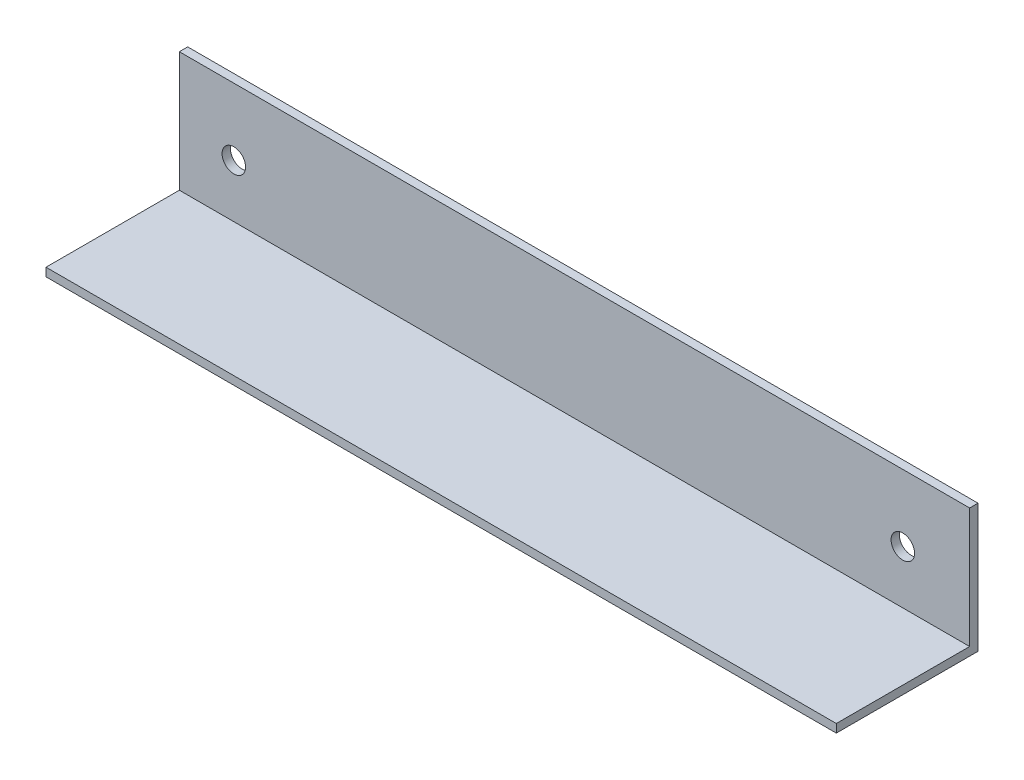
from build123d import *

# Parameters (mm, degrees)
SKETCH1_W           = 406.4
SKETCH1_H           = 24.384
BOSS_EXTRUDE1_DEPTH = 26.924
SKETCH2_W           = 406.4
SKETCH2_H           = 25.3365
CUT_EXTRUDE1_DEPTH  = 12.7
SKETCH3_W           = 406.4
SKETCH3_H           = 10.0965
CUT_EXTRUDE3_DEPTH  = 25.3365
SKETCH5_R           = 2.23393
CUT_EXTRUDE5_DEPTH  = 2.54
SKETCH6_W           = 287.305211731
SKETCH6_H           = 169.380750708
CUT_EXTRUDE6_DEPTH  = 65.024


with BuildPart() as part:
    # Sketch1 → Boss-Extrude1 (new body)
    with BuildSketch(Plane.XY):
        with Locations((-6.626086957, 55.646509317)):
            Rectangle(SKETCH1_W, SKETCH1_H)
    extrude(amount=BOSS_EXTRUDE1_DEPTH)

    # Sketch2 → Cut-Extrude1 (cut)
    with BuildSketch(Plane(origin=(0, 67.838509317, 0), x_dir=(1, 0, 0), z_dir=(0, 1, 0))):
        with Locations((-6.626086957, -14.25575)):
            Rectangle(SKETCH2_W, SKETCH2_H)
    extrude(amount=-CUT_EXTRUDE1_DEPTH, mode=Mode.SUBTRACT)

    # Sketch3 → Cut-Extrude3 (cut)
    with BuildSketch(Plane.XY.offset(26.924)):
        with Locations((-6.626086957, 50.090259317)):
            Rectangle(SKETCH3_W, SKETCH3_H)
    extrude(amount=-CUT_EXTRUDE3_DEPTH, mode=Mode.SUBTRACT)

    # Sketch5 → Cut-Extrude5 (cut)
    with BuildSketch(Plane(origin=(0, 0, 0), x_dir=(-1, 0, 0), z_dir=(0, 0, -1))):
        with Locations((-183.873913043, 55.138509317)):
            Circle(SKETCH5_R)
        with Locations((197.126086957, 55.138509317)):
            Circle(SKETCH5_R)
        with Locations((-56.75597279, 55.138509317)):
            Circle(SKETCH5_R)
    extrude(amount=-CUT_EXTRUDE5_DEPTH, mode=Mode.SUBTRACT)

    # Sketch6 → Cut-Extrude6 (cut)
    with BuildSketch(Plane.XZ.offset(-43.454509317)):
        with Locations((-97.251008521, -0.945202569)):
            Rectangle(SKETCH6_W, SKETCH6_H)
    extrude(amount=-CUT_EXTRUDE6_DEPTH, mode=Mode.SUBTRACT)


solid = part.part
